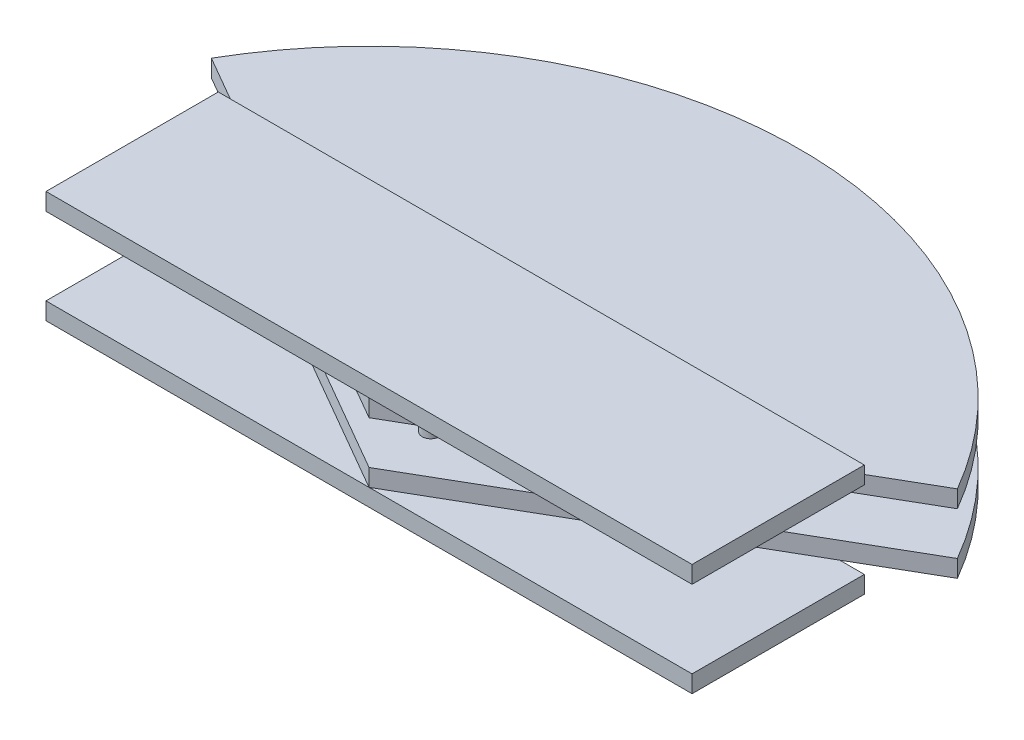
from build123d import *

# Parameters (mm, degrees)
BOSS_EXTRUDE2_DEPTH = 8
SKETCH5_W           = 300
SKETCH5_H           = 80
BOSS_EXTRUDE3_DEPTH = 8
SKETCH6_R           = 4
BOSS_EXTRUDE4_DEPTH = 20
BOSS_EXTRUDE5_START = 8
BOSS_EXTRUDE5_DEPTH = 8
SKETCH8_W           = 300
SKETCH8_H           = 80
BOSS_EXTRUDE6_DEPTH = 8


with BuildPart() as part:
    # Sketch4 → Boss-Extrude2 (new body)
    with BuildSketch(Plane(origin=(0, 0, 0), x_dir=(1, 0, 0), z_dir=(0, 1, 0))):
        with BuildLine():
            Line((0, 0), (173.205080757, 100))
            ThreePointArc((173.205080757, 100), (0, 200), (-173.205080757, 100))
            Line((-173.205080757, 100), (0, 0))
        make_face()
    extrude(amount=BOSS_EXTRUDE2_DEPTH)

    # Sketch5 → Boss-Extrude3 (add)
    with BuildSketch(Plane(origin=(0, 8, 0), x_dir=(1, 0, 0), z_dir=(0, 1, 0))):
        with Locations((0, 40)):
            Rectangle(SKETCH5_W, SKETCH5_H)
    extrude(amount=BOSS_EXTRUDE3_DEPTH)

    # Sketch6 → Boss-Extrude4 (add)
    with BuildSketch(Plane.XZ):
        with Locations(Location((0, -28.691404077, 0), (0, 0, 90))):
            Circle(SKETCH6_R)
    extrude(amount=BOSS_EXTRUDE4_DEPTH)

    # Sketch7 → Boss-Extrude5 (add)
    with BuildSketch(Plane.XZ.offset(20).offset(BOSS_EXTRUDE5_START)):
        with BuildLine():
            Line((0, 0), (-173.205080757, -100))
            ThreePointArc((-173.205080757, -100), (0, -200), (173.205080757, -100))
            Line((173.205080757, -100), (0, 0))
        make_face()
    extrude(amount=-BOSS_EXTRUDE5_DEPTH)

    # Sketch8 → Boss-Extrude6 (add)
    with BuildSketch(Plane.XZ.offset(28)):
        with Locations((0, -40)):
            Rectangle(SKETCH8_W, SKETCH8_H)
    extrude(amount=BOSS_EXTRUDE6_DEPTH)


solid = part.part
